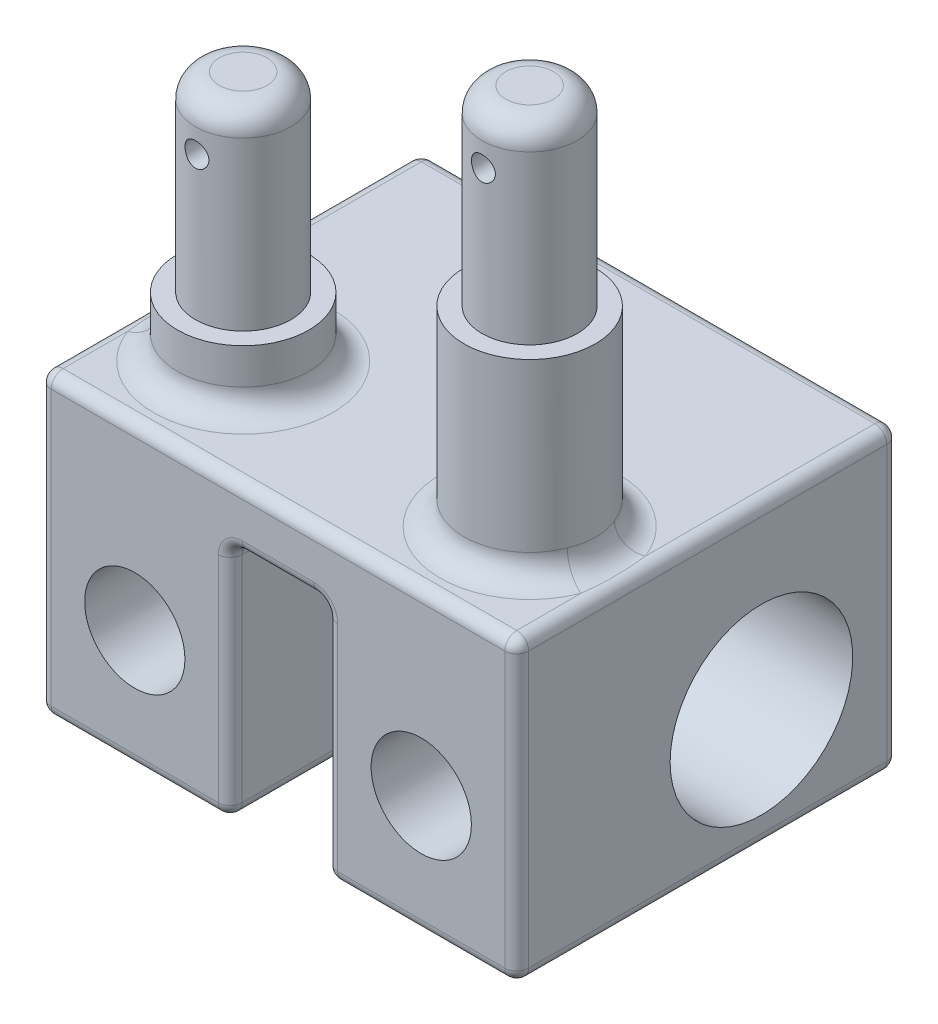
from build123d import *

# Parameters (mm, degrees)
SKETCH1_W               = 40
SKETCH1_H               = 30
BOSS_EXTRUDE1_DEPTH     = 5
SKETCH2_W               = 19
SKETCH2_H               = 20
SKETCH2_R               = 7.65
BOSS_EXTRUDE2_DEPTH     = 40
SKETCH3_W               = 16
SKETCH3_H               = 20
SKETCH3_R               = 4.2
BOSS_EXTRUDE3_DEPTH     = 11
SKETCH4_R               = 5.5
BOSS_EXTRUDE4_DEPTH     = 5
SKETCH7_R               = 5.5
BOSS_EXTRUDE7_DEPTH     = 11
SKETCH8_R               = 4
BOSS_EXTRUDE8_DEPTH     = 16
CUT_EXTRUDE1_DEPTH      = 76.624152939
CUT_EXTRUDE1_DEPTH_BACK = 76.624152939
SKETCH9_R               = 1
SKETCH10_R              = 4
BOSS_EXTRUDE9_DEPTH     = 16
CUT_EXTRUDE2_DEPTH      = 81.075042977
CUT_EXTRUDE2_DEPTH_BACK = 81.075042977
SKETCH11_R              = 1
SKETCH12_W              = 40
SKETCH12_H              = 25
BOSS_EXTRUDE10_DEPTH    = 2
FILLET3_R               = 1
FILLET4_R               = 2
FILLET5_R               = 2
FILLET7_R               = 2
FILLET8_R               = 2


with BuildPart() as part:
    # Sketch1 → Boss-Extrude1 (new body)
    with BuildSketch(Plane(origin=(0, 0, 0), x_dir=(1, 0, 0), z_dir=(0, 1, 0))):
        with Locations((-44.366237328, 12.49222575)):
            Rectangle(SKETCH1_W, SKETCH1_H)
    extrude(amount=BOSS_EXTRUDE1_DEPTH)

    # Sketch2 → Boss-Extrude2 (add)
    with BuildSketch(Plane.ZY.offset(64.366237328)):
        with Locations((-17.99222575, -10)):
            Rectangle(SKETCH2_W, SKETCH2_H)
        with Locations((-17.99222575, -10)):
            Circle(SKETCH2_R, mode=Mode.SUBTRACT)
    extrude(amount=-BOSS_EXTRUDE2_DEPTH)

    # Sketch3 → Boss-Extrude3 (add)
    # profile 1 of 2: a face of its own
    with BuildSketch(Plane.XY.offset(-8.49222575)):
        with Locations((-56.366237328, -10)):
            Rectangle(SKETCH3_W, SKETCH3_H)
        with Locations((-56.366237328, -10)):
            Circle(SKETCH3_R, mode=Mode.SUBTRACT)
    # profile 2 of 2: a face of its own
    with BuildSketch(Plane.XY.offset(-8.49222575)):
        with Locations((-32.366237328, -10)):
            Rectangle(SKETCH3_W, SKETCH3_H)
        with Locations((-32.366237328, -10)):
            Circle(SKETCH3_R, mode=Mode.SUBTRACT)
    extrude(amount=BOSS_EXTRUDE3_DEPTH)

    # Sketch4 → Boss-Extrude4 (add)
    with BuildSketch(Plane(origin=(0, 5, 0), x_dir=(1, 0, 0), z_dir=(0, 1, 0))):
        with Locations(Location((-56.366237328, 6.573224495, 0), (0, 0, 270))):
            Circle(SKETCH4_R)
        with Locations(Location((-32.366237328, 6.573224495, 0), (0, 0, 270))):
            Circle(SKETCH4_R)
    extrude(amount=BOSS_EXTRUDE4_DEPTH)

    # Sketch7 → Boss-Extrude7 (add)
    with BuildSketch(Plane(origin=(0, 10, 0), x_dir=(1, 0, 0), z_dir=(0, 1, 0))):
        with Locations(Location((-32.366237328, 6.573224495, 0), (0, 0, 270))):
            Circle(SKETCH7_R)
    extrude(amount=BOSS_EXTRUDE7_DEPTH)

    # Sketch8 → Boss-Extrude8 (add)
    with BuildSketch(Plane(origin=(0, 10, 0), x_dir=(1, 0, 0), z_dir=(0, 1, 0))):
        with Locations(Location((-56.366237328, 6.573224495, 0), (0, 0, 270))):
            Circle(SKETCH8_R)
    extrude(amount=BOSS_EXTRUDE8_DEPTH)

    # Sketch9 → Cut-Extrude1 (cut, two sides: drawn at the far end of the back side and taken through both)
    with BuildSketch(Plane.XY.offset(2.50777425).offset(-CUT_EXTRUDE1_DEPTH_BACK)):
        with Locations(Location((-56.366237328, 22, 0), (0, 0, 90.000000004))):
            Circle(SKETCH9_R)
    extrude(amount=CUT_EXTRUDE1_DEPTH + CUT_EXTRUDE1_DEPTH_BACK, mode=Mode.SUBTRACT)

    # Sketch10 → Boss-Extrude9 (add)
    with BuildSketch(Plane(origin=(0, 21, 0), x_dir=(1, 0, 0), z_dir=(0, 1, 0))):
        with Locations(Location((-32.366237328, 6.573224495, 0), (0, 0, 270))):
            Circle(SKETCH10_R)
    extrude(amount=BOSS_EXTRUDE9_DEPTH)

    # Sketch11 → Cut-Extrude2 (cut, two sides: drawn at the far end of the back side and taken through both)
    with BuildSketch(Plane.XY.offset(2.50777425).offset(-CUT_EXTRUDE2_DEPTH_BACK)):
        with Locations(Location((-32.366237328, 33, 0), (0, 0, 90.000000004))):
            Circle(SKETCH11_R)
    extrude(amount=CUT_EXTRUDE2_DEPTH + CUT_EXTRUDE2_DEPTH_BACK, mode=Mode.SUBTRACT)

    # Sketch12 → Boss-Extrude10 (add)
    with BuildSketch(Plane(origin=(0, 0, -27.49222575), x_dir=(-1, 0, 0), z_dir=(0, 0, -1))):
        with Locations((44.366237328, -7.5)):
            Rectangle(SKETCH12_W, SKETCH12_H)
    extrude(amount=BOSS_EXTRUDE10_DEPTH)

    # Fillet3
    fillet3_edges = [part.edges().sort_by_distance(p)[0] for p in [
        (-24.366237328, 5, -13.49222575),
        (-24.366237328, -20, -13.49222575),
        (-64.366237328, -20, -13.49222575),
        (-44.366237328, 0, 2.50777425),
        (-56.366237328, -20, 2.50777425),
        (-48.366237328, -10, 2.50777425),
        (-48.366237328, -10, -8.49222575),
        (-48.366237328, -20, -2.99222575),
        (-48.366237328, 0, -2.99222575),
        (-64.366237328, 5, -13.49222575),
        (-44.366237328, -20, -8.49222575),
        (-44.366237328, 0, -8.49222575),
        (-40.366237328, -10, 2.50777425),
        (-32.366237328, -20, 2.50777425),
        (-40.366237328, -10, -8.49222575),
        (-40.366237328, 0, -2.99222575),
        (-40.366237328, -20, -2.99222575),
        (-44.366237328, 5, 2.50777425),
        (-24.366237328, -7.5, 2.50777425),
        (-64.366237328, -7.5, 2.50777425),
        (-44.366237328, 5, -29.49222575),
        (-24.366237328, -7.5, -29.49222575),
        (-44.366237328, -20, -29.49222575),
        (-64.366237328, -7.5, -29.49222575),
    ]]
    fillet(fillet3_edges, radius=FILLET3_R)

    # Fillet4
    fillet4_edges = [part.edges().sort_by_distance(p)[0] for p in [
        (-56.366237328, 5, -12.073224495),
    ]]
    fillet(fillet4_edges, radius=FILLET4_R)

    # Fillet5
    fillet5_edges = [part.edges().sort_by_distance(p)[0] for p in [
        (-32.366237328, 5, -12.073224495),
    ]]
    fillet(fillet5_edges, radius=FILLET5_R)

    # Fillet7
    fillet7_edges = [part.edges().sort_by_distance(p)[0] for p in [
        (-56.366237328, 26, -10.573224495),
    ]]
    fillet(fillet7_edges, radius=FILLET7_R)

    # Fillet8
    fillet8_edges = [part.edges().sort_by_distance(p)[0] for p in [
        (-32.366237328, 37, -10.573224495),
    ]]
    fillet(fillet8_edges, radius=FILLET8_R)


solid = part.part
